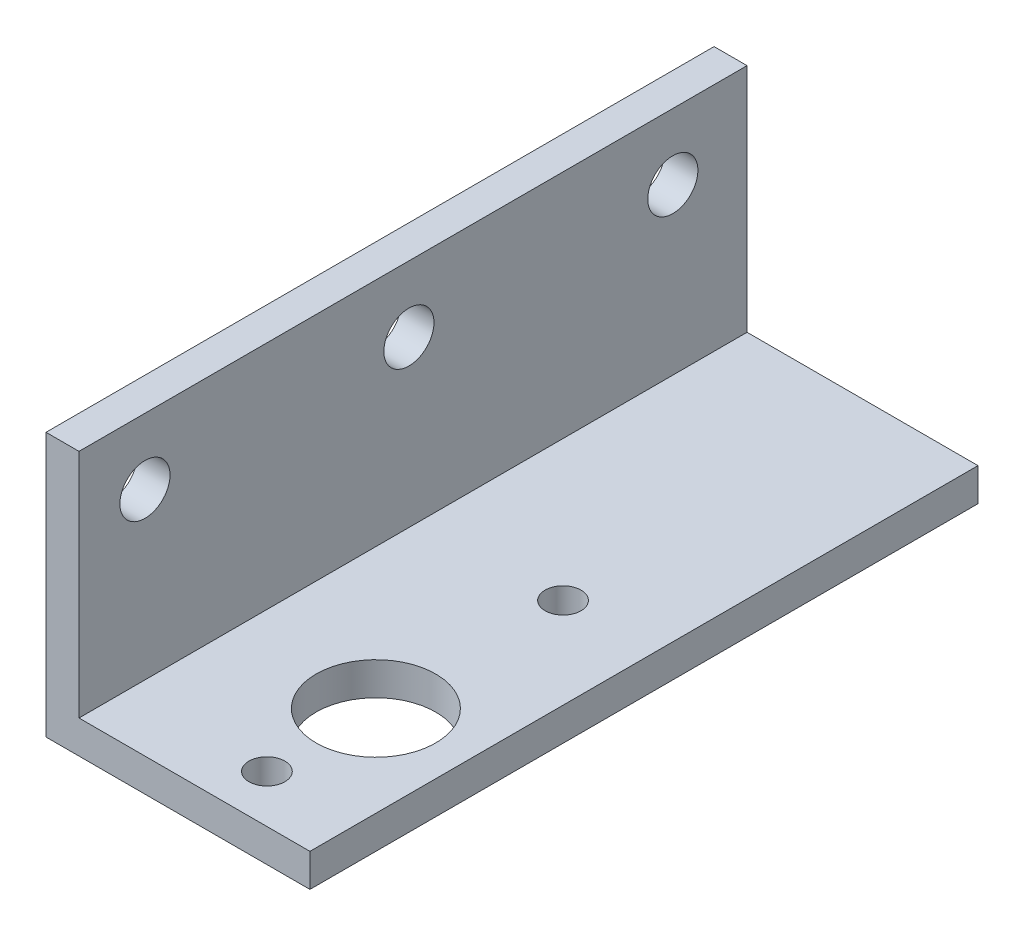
ISO-10303-21;
HEADER;
FILE_DESCRIPTION(('STEP AP214'),'2;1');
FILE_NAME('part.step','',(''),(''),'','','');
FILE_SCHEMA(('AUTOMOTIVE_DESIGN { 1 0 10303 214 1 1 1 1 }'));
ENDSEC;
DATA;
#1=APPLICATION_CONTEXT('core data for automotive mechanical design processes');
#2=APPLICATION_PROTOCOL_DEFINITION('international standard','automotive_design',2000,#1);
#3=PRODUCT_CONTEXT('',#1,'mechanical');
#4=PRODUCT('Part','Part','',(#3));
#5=PRODUCT_RELATED_PRODUCT_CATEGORY('part','',(#4));
#6=PRODUCT_DEFINITION_FORMATION('','',#4);
#7=PRODUCT_DEFINITION_CONTEXT('part definition',#1,'design');
#8=PRODUCT_DEFINITION('design','',#6,#7);
#9=PRODUCT_DEFINITION_SHAPE('','',#8);
#10=(LENGTH_UNIT() NAMED_UNIT(*) SI_UNIT(.MILLI.,.METRE.));
#11=(NAMED_UNIT(*) PLANE_ANGLE_UNIT() SI_UNIT($,.RADIAN.));
#12=(NAMED_UNIT(*) SI_UNIT($,.STERADIAN.) SOLID_ANGLE_UNIT());
#13=UNCERTAINTY_MEASURE_WITH_UNIT(LENGTH_MEASURE(1.E-05),#10,'distance_accuracy_value','');
#14=(GEOMETRIC_REPRESENTATION_CONTEXT(3) GLOBAL_UNCERTAINTY_ASSIGNED_CONTEXT((#13)) GLOBAL_UNIT_ASSIGNED_CONTEXT((#10,
#11,#12)) REPRESENTATION_CONTEXT('',''));
#15=CARTESIAN_POINT('',(0.,0.,0.));
#16=DIRECTION('',(0.,0.,1.));
#17=DIRECTION('',(1.,0.,0.));
#18=AXIS2_PLACEMENT_3D('',#15,#16,#17);
#19=CARTESIAN_POINT('',(3.175,0.,64.29375));
#20=DIRECTION('',(0.,-1.,0.));
#21=DIRECTION('',(1.,0.,0.));
#22=AXIS2_PLACEMENT_3D('',#19,#20,#21);
#23=PLANE('',#22);
#24=DIRECTION('',(-1.,0.,0.));
#25=VECTOR('',#24,1.);
#26=CARTESIAN_POINT('',(3.175,0.,0.));
#27=LINE('',#26,#25);
#28=CARTESIAN_POINT('',(3.175,0.,0.));
#29=VERTEX_POINT('',#28);
#30=CARTESIAN_POINT('',(0.,0.,0.));
#31=VERTEX_POINT('',#30);
#32=EDGE_CURVE('E118',#29,#31,#27,.T.);
#33=ORIENTED_EDGE('',*,*,#32,.T.);
#34=DIRECTION('',(0.,0.,-1.));
#35=VECTOR('',#34,1.);
#36=CARTESIAN_POINT('',(0.,0.,64.29375));
#37=LINE('',#36,#35);
#38=CARTESIAN_POINT('',(0.,0.,64.29375));
#39=VERTEX_POINT('',#38);
#40=EDGE_CURVE('E11',#39,#31,#37,.T.);
#41=ORIENTED_EDGE('',*,*,#40,.F.);
#42=DIRECTION('',(-1.,0.,0.));
#43=VECTOR('',#42,1.);
#44=CARTESIAN_POINT('',(3.175,0.,64.29375));
#45=LINE('',#44,#43);
#46=CARTESIAN_POINT('',(3.175,0.,64.29375));
#47=VERTEX_POINT('',#46);
#48=EDGE_CURVE('E129',#47,#39,#45,.T.);
#49=ORIENTED_EDGE('',*,*,#48,.F.);
#50=DIRECTION('',(0.,0.,-1.));
#51=VECTOR('',#50,1.);
#52=CARTESIAN_POINT('',(3.175,0.,64.29375));
#53=LINE('',#52,#51);
#54=EDGE_CURVE('E114',#47,#29,#53,.T.);
#55=ORIENTED_EDGE('',*,*,#54,.T.);
#56=EDGE_LOOP('',(#33,#41,#49,#55));
#57=FACE_BOUND('',#56,.T.);
#58=ADVANCED_FACE('F34',(#57),#23,.F.);
#59=CARTESIAN_POINT('',(0.,0.,64.29375));
#60=DIRECTION('',(1.,0.,0.));
#61=DIRECTION('',(0.,1.,0.));
#62=AXIS2_PLACEMENT_3D('',#59,#60,#61);
#63=PLANE('',#62);
#64=CARTESIAN_POINT('',(0.,-6.35,7.14375));
#65=DIRECTION('',(1.,0.,0.));
#66=DIRECTION('',(0.,1.,0.));
#67=AXIS2_PLACEMENT_3D('',#64,#65,#66);
#68=CIRCLE('',#67,2.413);
#69=CARTESIAN_POINT('',(0.,-3.937,7.14375));
#70=VERTEX_POINT('',#69);
#71=EDGE_CURVE('E309',#70,#70,#68,.F.);
#72=ORIENTED_EDGE('',*,*,#71,.F.);
#73=EDGE_LOOP('',(#72));
#74=FACE_BOUND('',#73,.T.);
#75=CARTESIAN_POINT('',(0.,-6.35,32.54375));
#76=DIRECTION('',(1.,0.,0.));
#77=DIRECTION('',(0.,1.,0.));
#78=AXIS2_PLACEMENT_3D('',#75,#76,#77);
#79=CIRCLE('',#78,2.41299999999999);
#80=CARTESIAN_POINT('',(0.,-3.937,32.54375));
#81=VERTEX_POINT('',#80);
#82=EDGE_CURVE('E303',#81,#81,#79,.F.);
#83=ORIENTED_EDGE('',*,*,#82,.F.);
#84=EDGE_LOOP('',(#83));
#85=FACE_BOUND('',#84,.T.);
#86=CARTESIAN_POINT('',(0.,-6.35,57.94375));
#87=DIRECTION('',(1.,0.,0.));
#88=DIRECTION('',(0.,1.,0.));
#89=AXIS2_PLACEMENT_3D('',#86,#87,#88);
#90=CIRCLE('',#89,2.413);
#91=CARTESIAN_POINT('',(0.,-3.937,57.94375));
#92=VERTEX_POINT('',#91);
#93=EDGE_CURVE('E297',#92,#92,#90,.F.);
#94=ORIENTED_EDGE('',*,*,#93,.F.);
#95=EDGE_LOOP('',(#94));
#96=FACE_BOUND('',#95,.T.);
#97=DIRECTION('',(0.,-1.,0.));
#98=VECTOR('',#97,1.);
#99=CARTESIAN_POINT('',(0.,0.,0.));
#100=LINE('',#99,#98);
#101=CARTESIAN_POINT('',(0.,-25.4,0.));
#102=VERTEX_POINT('',#101);
#103=EDGE_CURVE('E121',#31,#102,#100,.T.);
#104=ORIENTED_EDGE('',*,*,#103,.T.);
#105=DIRECTION('',(0.,0.,-1.));
#106=VECTOR('',#105,1.);
#107=CARTESIAN_POINT('',(0.,-25.4,64.29375));
#108=LINE('',#107,#106);
#109=CARTESIAN_POINT('',(0.,-25.4,64.29375));
#110=VERTEX_POINT('',#109);
#111=EDGE_CURVE('E42',#110,#102,#108,.T.);
#112=ORIENTED_EDGE('',*,*,#111,.F.);
#113=DIRECTION('',(0.,-1.,0.));
#114=VECTOR('',#113,1.);
#115=CARTESIAN_POINT('',(0.,0.,64.29375));
#116=LINE('',#115,#114);
#117=EDGE_CURVE('E87',#39,#110,#116,.T.);
#118=ORIENTED_EDGE('',*,*,#117,.F.);
#119=ORIENTED_EDGE('',*,*,#40,.T.);
#120=EDGE_LOOP('',(#104,#112,#118,#119));
#121=FACE_BOUND('',#120,.T.);
#122=ADVANCED_FACE('F157',(#74,#85,#96,#121),#63,.F.);
#123=CARTESIAN_POINT('',(0.,-25.4,64.29375));
#124=DIRECTION('',(0.,1.,0.));
#125=DIRECTION('',(0.,0.,1.));
#126=AXIS2_PLACEMENT_3D('',#123,#124,#125);
#127=PLANE('',#126);
#128=CARTESIAN_POINT('',(16.66875,-25.4,31.2039));
#129=DIRECTION('',(0.,1.,0.));
#130=DIRECTION('',(0.,0.,1.));
#131=AXIS2_PLACEMENT_3D('',#128,#129,#130);
#132=CIRCLE('',#131,1.7272);
#133=CARTESIAN_POINT('',(16.66875,-25.4,32.9311));
#134=VERTEX_POINT('',#133);
#135=EDGE_CURVE('E291',#134,#134,#132,.T.);
#136=ORIENTED_EDGE('',*,*,#135,.T.);
#137=EDGE_LOOP('',(#136));
#138=FACE_BOUND('',#137,.T.);
#139=CARTESIAN_POINT('',(16.66875,-25.4,59.7027));
#140=DIRECTION('',(0.,1.,0.));
#141=DIRECTION('',(0.,0.,1.));
#142=AXIS2_PLACEMENT_3D('',#139,#140,#141);
#143=CIRCLE('',#142,1.7272);
#144=CARTESIAN_POINT('',(16.66875,-25.4,61.4299));
#145=VERTEX_POINT('',#144);
#146=EDGE_CURVE('E281',#145,#145,#143,.T.);
#147=ORIENTED_EDGE('',*,*,#146,.T.);
#148=EDGE_LOOP('',(#147));
#149=FACE_BOUND('',#148,.T.);
#150=CARTESIAN_POINT('',(16.66875,-25.4,49.2125));
#151=DIRECTION('',(0.,1.,0.));
#152=DIRECTION('',(0.,0.,1.));
#153=AXIS2_PLACEMENT_3D('',#150,#151,#152);
#154=CIRCLE('',#153,5.7531);
#155=CARTESIAN_POINT('',(16.66875,-25.4,54.9656));
#156=VERTEX_POINT('',#155);
#157=EDGE_CURVE('E122',#156,#156,#154,.F.);
#158=ORIENTED_EDGE('',*,*,#157,.F.);
#159=EDGE_LOOP('',(#158));
#160=FACE_BOUND('',#159,.T.);
#161=DIRECTION('',(1.,0.,0.));
#162=VECTOR('',#161,1.);
#163=CARTESIAN_POINT('',(0.,-25.4,0.));
#164=LINE('',#163,#162);
#165=CARTESIAN_POINT('',(25.4,-25.4,0.));
#166=VERTEX_POINT('',#165);
#167=EDGE_CURVE('E124',#102,#166,#164,.T.);
#168=ORIENTED_EDGE('',*,*,#167,.T.);
#169=DIRECTION('',(0.,0.,-1.));
#170=VECTOR('',#169,1.);
#171=CARTESIAN_POINT('',(25.4,-25.4,64.29375));
#172=LINE('',#171,#170);
#173=CARTESIAN_POINT('',(25.4,-25.4,64.29375));
#174=VERTEX_POINT('',#173);
#175=EDGE_CURVE('E109',#174,#166,#172,.T.);
#176=ORIENTED_EDGE('',*,*,#175,.F.);
#177=DIRECTION('',(1.,0.,0.));
#178=VECTOR('',#177,1.);
#179=CARTESIAN_POINT('',(0.,-25.4,64.29375));
#180=LINE('',#179,#178);
#181=EDGE_CURVE('E100',#110,#174,#180,.T.);
#182=ORIENTED_EDGE('',*,*,#181,.F.);
#183=ORIENTED_EDGE('',*,*,#111,.T.);
#184=EDGE_LOOP('',(#168,#176,#182,#183));
#185=FACE_BOUND('',#184,.T.);
#186=ADVANCED_FACE('F135',(#138,#149,#160,#185),#127,.F.);
#187=CARTESIAN_POINT('',(25.4,-25.4,64.29375));
#188=DIRECTION('',(-1.,0.,0.));
#189=DIRECTION('',(0.,0.,1.));
#190=AXIS2_PLACEMENT_3D('',#187,#188,#189);
#191=PLANE('',#190);
#192=DIRECTION('',(0.,1.,0.));
#193=VECTOR('',#192,1.);
#194=CARTESIAN_POINT('',(25.4,-25.4,0.));
#195=LINE('',#194,#193);
#196=CARTESIAN_POINT('',(25.4,-22.225,0.));
#197=VERTEX_POINT('',#196);
#198=EDGE_CURVE('E108',#166,#197,#195,.T.);
#199=ORIENTED_EDGE('',*,*,#198,.T.);
#200=DIRECTION('',(0.,0.,-1.));
#201=VECTOR('',#200,1.);
#202=CARTESIAN_POINT('',(25.4,-22.225,64.29375));
#203=LINE('',#202,#201);
#204=CARTESIAN_POINT('',(25.4,-22.225,64.29375));
#205=VERTEX_POINT('',#204);
#206=EDGE_CURVE('E105',#205,#197,#203,.T.);
#207=ORIENTED_EDGE('',*,*,#206,.F.);
#208=DIRECTION('',(0.,1.,0.));
#209=VECTOR('',#208,1.);
#210=CARTESIAN_POINT('',(25.4,-25.4,64.29375));
#211=LINE('',#210,#209);
#212=EDGE_CURVE('E94',#174,#205,#211,.T.);
#213=ORIENTED_EDGE('',*,*,#212,.F.);
#214=ORIENTED_EDGE('',*,*,#175,.T.);
#215=EDGE_LOOP('',(#199,#207,#213,#214));
#216=FACE_BOUND('',#215,.T.);
#217=ADVANCED_FACE('F106',(#216),#191,.F.);
#218=CARTESIAN_POINT('',(25.4,-22.225,64.29375));
#219=DIRECTION('',(0.,-1.,0.));
#220=DIRECTION('',(1.,0.,0.));
#221=AXIS2_PLACEMENT_3D('',#218,#219,#220);
#222=PLANE('',#221);
#223=CARTESIAN_POINT('',(16.66875,-22.225,31.2039));
#224=DIRECTION('',(0.,1.,0.));
#225=DIRECTION('',(0.,0.,1.));
#226=AXIS2_PLACEMENT_3D('',#223,#224,#225);
#227=CIRCLE('',#226,1.7272);
#228=CARTESIAN_POINT('',(16.66875,-22.225,32.9311));
#229=VERTEX_POINT('',#228);
#230=EDGE_CURVE('E294',#229,#229,#227,.T.);
#231=ORIENTED_EDGE('',*,*,#230,.F.);
#232=EDGE_LOOP('',(#231));
#233=FACE_BOUND('',#232,.T.);
#234=CARTESIAN_POINT('',(16.66875,-22.225,59.7027));
#235=DIRECTION('',(0.,1.,0.));
#236=DIRECTION('',(0.,0.,1.));
#237=AXIS2_PLACEMENT_3D('',#234,#235,#236);
#238=CIRCLE('',#237,1.7272);
#239=CARTESIAN_POINT('',(16.66875,-22.225,61.4299));
#240=VERTEX_POINT('',#239);
#241=EDGE_CURVE('E288',#240,#240,#238,.T.);
#242=ORIENTED_EDGE('',*,*,#241,.F.);
#243=EDGE_LOOP('',(#242));
#244=FACE_BOUND('',#243,.T.);
#245=CARTESIAN_POINT('',(16.66875,-22.225,49.2125));
#246=DIRECTION('',(0.,1.,0.));
#247=DIRECTION('',(-1.,0.,0.));
#248=AXIS2_PLACEMENT_3D('',#245,#246,#247);
#249=CIRCLE('',#248,5.7531);
#250=CARTESIAN_POINT('',(10.91565,-22.225,49.2125));
#251=VERTEX_POINT('',#250);
#252=EDGE_CURVE('E276',#251,#251,#249,.T.);
#253=ORIENTED_EDGE('',*,*,#252,.F.);
#254=EDGE_LOOP('',(#253));
#255=FACE_BOUND('',#254,.T.);
#256=DIRECTION('',(-1.,0.,0.));
#257=VECTOR('',#256,1.);
#258=CARTESIAN_POINT('',(25.4,-22.225,0.));
#259=LINE('',#258,#257);
#260=CARTESIAN_POINT('',(3.175,-22.225,0.));
#261=VERTEX_POINT('',#260);
#262=EDGE_CURVE('E73',#197,#261,#259,.T.);
#263=ORIENTED_EDGE('',*,*,#262,.T.);
#264=DIRECTION('',(0.,0.,-1.));
#265=VECTOR('',#264,1.);
#266=CARTESIAN_POINT('',(3.175,-22.225,64.29375));
#267=LINE('',#266,#265);
#268=CARTESIAN_POINT('',(3.175,-22.225,64.29375));
#269=VERTEX_POINT('',#268);
#270=EDGE_CURVE('E110',#269,#261,#267,.T.);
#271=ORIENTED_EDGE('',*,*,#270,.F.);
#272=DIRECTION('',(-1.,0.,0.));
#273=VECTOR('',#272,1.);
#274=CARTESIAN_POINT('',(25.4,-22.225,64.29375));
#275=LINE('',#274,#273);
#276=EDGE_CURVE('E98',#205,#269,#275,.T.);
#277=ORIENTED_EDGE('',*,*,#276,.F.);
#278=ORIENTED_EDGE('',*,*,#206,.T.);
#279=EDGE_LOOP('',(#263,#271,#277,#278));
#280=FACE_BOUND('',#279,.T.);
#281=ADVANCED_FACE('F112',(#233,#244,#255,#280),#222,.F.);
#282=CARTESIAN_POINT('',(3.175,-22.225,64.29375));
#283=DIRECTION('',(-1.,0.,0.));
#284=DIRECTION('',(0.,-1.,0.));
#285=AXIS2_PLACEMENT_3D('',#282,#283,#284);
#286=PLANE('',#285);
#287=CARTESIAN_POINT('',(3.175,-6.35,7.14375));
#288=DIRECTION('',(1.,0.,0.));
#289=DIRECTION('',(0.,1.,0.));
#290=AXIS2_PLACEMENT_3D('',#287,#288,#289);
#291=CIRCLE('',#290,2.413);
#292=CARTESIAN_POINT('',(3.175,-3.937,7.14375));
#293=VERTEX_POINT('',#292);
#294=EDGE_CURVE('E312',#293,#293,#291,.T.);
#295=ORIENTED_EDGE('',*,*,#294,.F.);
#296=EDGE_LOOP('',(#295));
#297=FACE_BOUND('',#296,.T.);
#298=CARTESIAN_POINT('',(3.175,-6.35,32.54375));
#299=DIRECTION('',(1.,0.,0.));
#300=DIRECTION('',(0.,1.,0.));
#301=AXIS2_PLACEMENT_3D('',#298,#299,#300);
#302=CIRCLE('',#301,2.41299999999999);
#303=CARTESIAN_POINT('',(3.175,-3.937,32.54375));
#304=VERTEX_POINT('',#303);
#305=EDGE_CURVE('E306',#304,#304,#302,.T.);
#306=ORIENTED_EDGE('',*,*,#305,.F.);
#307=EDGE_LOOP('',(#306));
#308=FACE_BOUND('',#307,.T.);
#309=CARTESIAN_POINT('',(3.175,-6.35,57.94375));
#310=DIRECTION('',(1.,0.,0.));
#311=DIRECTION('',(0.,1.,0.));
#312=AXIS2_PLACEMENT_3D('',#309,#310,#311);
#313=CIRCLE('',#312,2.413);
#314=CARTESIAN_POINT('',(3.175,-3.937,57.94375));
#315=VERTEX_POINT('',#314);
#316=EDGE_CURVE('E300',#315,#315,#313,.T.);
#317=ORIENTED_EDGE('',*,*,#316,.F.);
#318=EDGE_LOOP('',(#317));
#319=FACE_BOUND('',#318,.T.);
#320=DIRECTION('',(0.,1.,0.));
#321=VECTOR('',#320,1.);
#322=CARTESIAN_POINT('',(3.175,-22.225,0.));
#323=LINE('',#322,#321);
#324=EDGE_CURVE('E79',#261,#29,#323,.T.);
#325=ORIENTED_EDGE('',*,*,#324,.T.);
#326=ORIENTED_EDGE('',*,*,#54,.F.);
#327=DIRECTION('',(0.,1.,0.));
#328=VECTOR('',#327,1.);
#329=CARTESIAN_POINT('',(3.175,-22.225,64.29375));
#330=LINE('',#329,#328);
#331=EDGE_CURVE('E50',#269,#47,#330,.T.);
#332=ORIENTED_EDGE('',*,*,#331,.F.);
#333=ORIENTED_EDGE('',*,*,#270,.T.);
#334=EDGE_LOOP('',(#325,#326,#332,#333));
#335=FACE_BOUND('',#334,.T.);
#336=ADVANCED_FACE('F142',(#297,#308,#319,#335),#286,.F.);
#337=CARTESIAN_POINT('',(0.,0.,64.29375));
#338=DIRECTION('',(0.,0.,1.));
#339=DIRECTION('',(1.,0.,0.));
#340=AXIS2_PLACEMENT_3D('',#337,#338,#339);
#341=PLANE('',#340);
#342=ORIENTED_EDGE('',*,*,#48,.T.);
#343=ORIENTED_EDGE('',*,*,#117,.T.);
#344=ORIENTED_EDGE('',*,*,#181,.T.);
#345=ORIENTED_EDGE('',*,*,#212,.T.);
#346=ORIENTED_EDGE('',*,*,#276,.T.);
#347=ORIENTED_EDGE('',*,*,#331,.T.);
#348=EDGE_LOOP('',(#342,#343,#344,#345,#346,#347));
#349=FACE_BOUND('',#348,.T.);
#350=ADVANCED_FACE('F96',(#349),#341,.T.);
#351=CARTESIAN_POINT('',(0.,0.,0.));
#352=DIRECTION('',(0.,0.,1.));
#353=DIRECTION('',(1.,0.,0.));
#354=AXIS2_PLACEMENT_3D('',#351,#352,#353);
#355=PLANE('',#354);
#356=ORIENTED_EDGE('',*,*,#32,.F.);
#357=ORIENTED_EDGE('',*,*,#324,.F.);
#358=ORIENTED_EDGE('',*,*,#262,.F.);
#359=ORIENTED_EDGE('',*,*,#198,.F.);
#360=ORIENTED_EDGE('',*,*,#167,.F.);
#361=ORIENTED_EDGE('',*,*,#103,.F.);
#362=EDGE_LOOP('',(#356,#357,#358,#359,#360,#361));
#363=FACE_BOUND('',#362,.T.);
#364=ADVANCED_FACE('F138',(#363),#355,.F.);
#365=CARTESIAN_POINT('',(16.66875,-25.401,49.2125));
#366=DIRECTION('',(0.,1.,0.));
#367=DIRECTION('',(-1.,0.,0.));
#368=AXIS2_PLACEMENT_3D('',#365,#366,#367);
#369=CYLINDRICAL_SURFACE('',#368,5.7531);
#370=ORIENTED_EDGE('',*,*,#252,.T.);
#371=EDGE_LOOP('',(#370));
#372=FACE_BOUND('',#371,.T.);
#373=ORIENTED_EDGE('',*,*,#157,.T.);
#374=EDGE_LOOP('',(#373));
#375=FACE_BOUND('',#374,.T.);
#376=ADVANCED_FACE('F196',(#372,#375),#369,.F.);
#377=CARTESIAN_POINT('',(16.66875,-22.225,59.7027));
#378=DIRECTION('',(0.,1.,0.));
#379=DIRECTION('',(0.,0.,1.));
#380=AXIS2_PLACEMENT_3D('',#377,#378,#379);
#381=CYLINDRICAL_SURFACE('',#380,1.7272);
#382=ORIENTED_EDGE('',*,*,#146,.F.);
#383=EDGE_LOOP('',(#382));
#384=FACE_BOUND('',#383,.T.);
#385=ORIENTED_EDGE('',*,*,#241,.T.);
#386=EDGE_LOOP('',(#385));
#387=FACE_BOUND('',#386,.T.);
#388=ADVANCED_FACE('F189',(#384,#387),#381,.F.);
#389=CARTESIAN_POINT('',(16.66875,-22.225,31.2039));
#390=DIRECTION('',(0.,1.,0.));
#391=DIRECTION('',(0.,0.,1.));
#392=AXIS2_PLACEMENT_3D('',#389,#390,#391);
#393=CYLINDRICAL_SURFACE('',#392,1.7272);
#394=ORIENTED_EDGE('',*,*,#135,.F.);
#395=EDGE_LOOP('',(#394));
#396=FACE_BOUND('',#395,.T.);
#397=ORIENTED_EDGE('',*,*,#230,.T.);
#398=EDGE_LOOP('',(#397));
#399=FACE_BOUND('',#398,.T.);
#400=ADVANCED_FACE('F195',(#396,#399),#393,.F.);
#401=CARTESIAN_POINT('',(-0.001000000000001,-6.35,57.94375));
#402=DIRECTION('',(1.,0.,0.));
#403=DIRECTION('',(0.,1.,0.));
#404=AXIS2_PLACEMENT_3D('',#401,#402,#403);
#405=CYLINDRICAL_SURFACE('',#404,2.413);
#406=ORIENTED_EDGE('',*,*,#316,.T.);
#407=EDGE_LOOP('',(#406));
#408=FACE_BOUND('',#407,.T.);
#409=ORIENTED_EDGE('',*,*,#93,.T.);
#410=EDGE_LOOP('',(#409));
#411=FACE_BOUND('',#410,.T.);
#412=ADVANCED_FACE('F207',(#408,#411),#405,.F.);
#413=CARTESIAN_POINT('',(-0.001000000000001,-6.35,32.54375));
#414=DIRECTION('',(1.,0.,0.));
#415=DIRECTION('',(0.,1.,0.));
#416=AXIS2_PLACEMENT_3D('',#413,#414,#415);
#417=CYLINDRICAL_SURFACE('',#416,2.41299999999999);
#418=ORIENTED_EDGE('',*,*,#305,.T.);
#419=EDGE_LOOP('',(#418));
#420=FACE_BOUND('',#419,.T.);
#421=ORIENTED_EDGE('',*,*,#82,.T.);
#422=EDGE_LOOP('',(#421));
#423=FACE_BOUND('',#422,.T.);
#424=ADVANCED_FACE('F227',(#420,#423),#417,.F.);
#425=CARTESIAN_POINT('',(-0.001000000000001,-6.35,7.14375));
#426=DIRECTION('',(1.,0.,0.));
#427=DIRECTION('',(0.,1.,0.));
#428=AXIS2_PLACEMENT_3D('',#425,#426,#427);
#429=CYLINDRICAL_SURFACE('',#428,2.413);
#430=ORIENTED_EDGE('',*,*,#294,.T.);
#431=EDGE_LOOP('',(#430));
#432=FACE_BOUND('',#431,.T.);
#433=ORIENTED_EDGE('',*,*,#71,.T.);
#434=EDGE_LOOP('',(#433));
#435=FACE_BOUND('',#434,.T.);
#436=ADVANCED_FACE('F237',(#432,#435),#429,.F.);
#437=CLOSED_SHELL('',(#58,#122,#186,#217,#281,#336,#350,#364,#376,#388,#400,#412,#424,#436));
#438=MANIFOLD_SOLID_BREP('B2',#437);
#439=ADVANCED_BREP_SHAPE_REPRESENTATION('',(#18,#438),#14);
#440=SHAPE_DEFINITION_REPRESENTATION(#9,#439);
ENDSEC;
END-ISO-10303-21;
